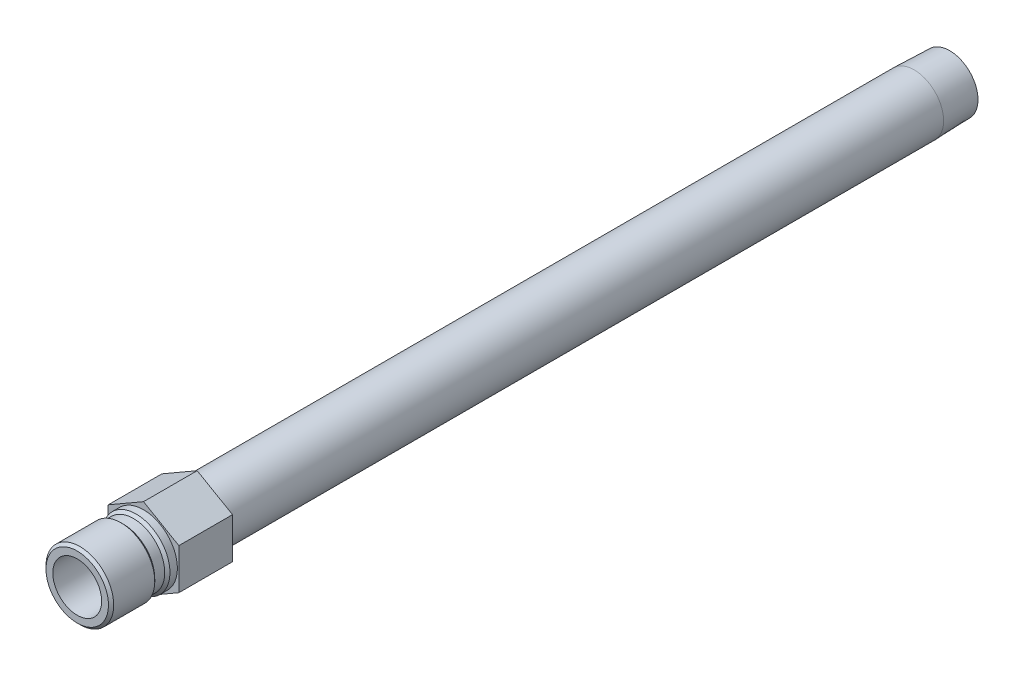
ISO-10303-21;
HEADER;
FILE_DESCRIPTION(('STEP AP214'),'2;1');
FILE_NAME('part.step','',(''),(''),'','','');
FILE_SCHEMA(('AUTOMOTIVE_DESIGN { 1 0 10303 214 1 1 1 1 }'));
ENDSEC;
DATA;
#1=APPLICATION_CONTEXT('core data for automotive mechanical design processes');
#2=APPLICATION_PROTOCOL_DEFINITION('international standard','automotive_design',2000,#1);
#3=PRODUCT_CONTEXT('',#1,'mechanical');
#4=PRODUCT('Part','Part','',(#3));
#5=PRODUCT_RELATED_PRODUCT_CATEGORY('part','',(#4));
#6=PRODUCT_DEFINITION_FORMATION('','',#4);
#7=PRODUCT_DEFINITION_CONTEXT('part definition',#1,'design');
#8=PRODUCT_DEFINITION('design','',#6,#7);
#9=PRODUCT_DEFINITION_SHAPE('','',#8);
#10=(LENGTH_UNIT() NAMED_UNIT(*) SI_UNIT(.MILLI.,.METRE.));
#11=(NAMED_UNIT(*) PLANE_ANGLE_UNIT() SI_UNIT($,.RADIAN.));
#12=(NAMED_UNIT(*) SI_UNIT($,.STERADIAN.) SOLID_ANGLE_UNIT());
#13=UNCERTAINTY_MEASURE_WITH_UNIT(LENGTH_MEASURE(1.E-05),#10,'distance_accuracy_value','');
#14=(GEOMETRIC_REPRESENTATION_CONTEXT(3) GLOBAL_UNCERTAINTY_ASSIGNED_CONTEXT((#13)) GLOBAL_UNIT_ASSIGNED_CONTEXT((#10,
#11,#12)) REPRESENTATION_CONTEXT('',''));
#15=CARTESIAN_POINT('',(0.,0.,0.));
#16=DIRECTION('',(0.,0.,1.));
#17=DIRECTION('',(1.,0.,0.));
#18=AXIS2_PLACEMENT_3D('',#15,#16,#17);
#19=CARTESIAN_POINT('',(0.,0.,0.));
#20=DIRECTION('',(0.,0.,-1.));
#21=DIRECTION('',(0.,1.,0.));
#22=AXIS2_PLACEMENT_3D('',#19,#20,#21);
#23=CYLINDRICAL_SURFACE('',#22,8.5725);
#24=CARTESIAN_POINT('',(0.,0.,-224.3582));
#25=DIRECTION('',(0.,0.,-1.));
#26=DIRECTION('',(0.,1.,0.));
#27=AXIS2_PLACEMENT_3D('',#24,#25,#26);
#28=CIRCLE('',#27,8.57250000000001);
#29=CARTESIAN_POINT('',(0.,8.5725,-224.3582));
#30=VERTEX_POINT('',#29);
#31=EDGE_CURVE('E158',#30,#30,#28,.T.);
#32=ORIENTED_EDGE('',*,*,#31,.F.);
#33=EDGE_LOOP('',(#32));
#34=FACE_BOUND('',#33,.T.);
#35=CARTESIAN_POINT('',(0.,0.,-15.621));
#36=DIRECTION('',(0.,0.,1.));
#37=DIRECTION('',(1.,0.,0.));
#38=AXIS2_PLACEMENT_3D('',#35,#36,#37);
#39=CIRCLE('',#38,8.5725);
#40=CARTESIAN_POINT('',(8.5725,0.,-15.621));
#41=VERTEX_POINT('',#40);
#42=EDGE_CURVE('E39',#41,#41,#39,.F.);
#43=ORIENTED_EDGE('',*,*,#42,.T.);
#44=EDGE_LOOP('',(#43));
#45=FACE_BOUND('',#44,.T.);
#46=ADVANCED_FACE('F35',(#34,#45),#23,.T.);
#47=CARTESIAN_POINT('',(0.,0.,0.));
#48=DIRECTION('',(0.,0.,-1.));
#49=DIRECTION('',(0.,1.,0.));
#50=AXIS2_PLACEMENT_3D('',#47,#48,#49);
#51=CYLINDRICAL_SURFACE('',#50,7.112);
#52=CARTESIAN_POINT('',(0.,0.,1.524));
#53=DIRECTION('',(0.,0.,-1.));
#54=DIRECTION('',(0.,1.,0.));
#55=AXIS2_PLACEMENT_3D('',#52,#53,#54);
#56=CIRCLE('',#55,7.112);
#57=CARTESIAN_POINT('',(0.,7.112,1.524));
#58=VERTEX_POINT('',#57);
#59=EDGE_CURVE('E146',#58,#58,#56,.T.);
#60=ORIENTED_EDGE('',*,*,#59,.T.);
#61=EDGE_LOOP('',(#60));
#62=FACE_BOUND('',#61,.T.);
#63=CARTESIAN_POINT('',(0.,0.,19.304));
#64=DIRECTION('',(0.,0.,-1.));
#65=DIRECTION('',(0.,1.,0.));
#66=AXIS2_PLACEMENT_3D('',#63,#64,#65);
#67=CIRCLE('',#66,7.112);
#68=CARTESIAN_POINT('',(0.,7.112,19.304));
#69=VERTEX_POINT('',#68);
#70=EDGE_CURVE('E11',#69,#69,#67,.T.);
#71=ORIENTED_EDGE('',*,*,#70,.F.);
#72=EDGE_LOOP('',(#71));
#73=FACE_BOUND('',#72,.T.);
#74=ADVANCED_FACE('F37',(#62,#73),#51,.F.);
#75=CARTESIAN_POINT('',(0.,7.112,19.304));
#76=DIRECTION('',(0.,0.,1.));
#77=DIRECTION('',(0.,-1.,0.));
#78=AXIS2_PLACEMENT_3D('',#75,#76,#77);
#79=PLANE('',#78);
#80=ORIENTED_EDGE('',*,*,#70,.T.);
#81=EDGE_LOOP('',(#80));
#82=FACE_BOUND('',#81,.T.);
#83=CARTESIAN_POINT('',(0.,0.,19.304));
#84=DIRECTION('',(0.,0.,-1.));
#85=DIRECTION('',(0.,1.,0.));
#86=AXIS2_PLACEMENT_3D('',#83,#84,#85);
#87=CIRCLE('',#86,9.09319999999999);
#88=CARTESIAN_POINT('',(0.,9.0932,19.304));
#89=VERTEX_POINT('',#88);
#90=EDGE_CURVE('E45',#89,#89,#87,.T.);
#91=ORIENTED_EDGE('',*,*,#90,.F.);
#92=EDGE_LOOP('',(#91));
#93=FACE_BOUND('',#92,.T.);
#94=ADVANCED_FACE('F185',(#82,#93),#79,.T.);
#95=CARTESIAN_POINT('',(0.,0.,18.542));
#96=DIRECTION('',(0.,0.,-1.));
#97=DIRECTION('',(0.,1.,0.));
#98=AXIS2_PLACEMENT_3D('',#95,#96,#97);
#99=CONICAL_SURFACE('',#98,9.8552,0.785398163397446);
#100=ORIENTED_EDGE('',*,*,#90,.T.);
#101=EDGE_LOOP('',(#100));
#102=FACE_BOUND('',#101,.T.);
#103=CARTESIAN_POINT('',(0.,0.,18.542));
#104=DIRECTION('',(0.,0.,-1.));
#105=DIRECTION('',(0.,1.,0.));
#106=AXIS2_PLACEMENT_3D('',#103,#104,#105);
#107=CIRCLE('',#106,9.8552);
#108=CARTESIAN_POINT('',(0.,9.8552,18.542));
#109=VERTEX_POINT('',#108);
#110=EDGE_CURVE('E176',#109,#109,#107,.T.);
#111=ORIENTED_EDGE('',*,*,#110,.F.);
#112=EDGE_LOOP('',(#111));
#113=FACE_BOUND('',#112,.T.);
#114=ADVANCED_FACE('F182',(#102,#113),#99,.T.);
#115=CARTESIAN_POINT('',(0.,0.,0.));
#116=DIRECTION('',(0.,0.,-1.));
#117=DIRECTION('',(0.,1.,0.));
#118=AXIS2_PLACEMENT_3D('',#115,#116,#117);
#119=CYLINDRICAL_SURFACE('',#118,9.8552);
#120=ORIENTED_EDGE('',*,*,#110,.T.);
#121=EDGE_LOOP('',(#120));
#122=FACE_BOUND('',#121,.T.);
#123=CARTESIAN_POINT('',(0.,0.,6.5786));
#124=DIRECTION('',(0.,0.,-1.));
#125=DIRECTION('',(0.,1.,0.));
#126=AXIS2_PLACEMENT_3D('',#123,#124,#125);
#127=CIRCLE('',#126,9.8552);
#128=CARTESIAN_POINT('',(0.,9.8552,6.5786));
#129=VERTEX_POINT('',#128);
#130=EDGE_CURVE('E173',#129,#129,#127,.T.);
#131=ORIENTED_EDGE('',*,*,#130,.F.);
#132=EDGE_LOOP('',(#131));
#133=FACE_BOUND('',#132,.T.);
#134=ADVANCED_FACE('F192',(#122,#133),#119,.T.);
#135=CARTESIAN_POINT('',(0.,0.,5.8166));
#136=DIRECTION('',(0.,0.,1.));
#137=DIRECTION('',(0.,-1.,0.));
#138=AXIS2_PLACEMENT_3D('',#135,#136,#137);
#139=CONICAL_SURFACE('',#138,9.0932,0.785398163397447);
#140=ORIENTED_EDGE('',*,*,#130,.T.);
#141=EDGE_LOOP('',(#140));
#142=FACE_BOUND('',#141,.T.);
#143=CARTESIAN_POINT('',(0.,0.,5.8166));
#144=DIRECTION('',(0.,0.,-1.));
#145=DIRECTION('',(0.,1.,0.));
#146=AXIS2_PLACEMENT_3D('',#143,#144,#145);
#147=CIRCLE('',#146,9.0932);
#148=CARTESIAN_POINT('',(0.,9.0932,5.8166));
#149=VERTEX_POINT('',#148);
#150=EDGE_CURVE('E170',#149,#149,#147,.T.);
#151=ORIENTED_EDGE('',*,*,#150,.F.);
#152=EDGE_LOOP('',(#151));
#153=FACE_BOUND('',#152,.T.);
#154=ADVANCED_FACE('F217',(#142,#153),#139,.T.);
#155=CARTESIAN_POINT('',(0.,0.,0.));
#156=DIRECTION('',(0.,0.,-1.));
#157=DIRECTION('',(0.,1.,0.));
#158=AXIS2_PLACEMENT_3D('',#155,#156,#157);
#159=CYLINDRICAL_SURFACE('',#158,9.0932);
#160=ORIENTED_EDGE('',*,*,#150,.T.);
#161=EDGE_LOOP('',(#160));
#162=FACE_BOUND('',#161,.T.);
#163=CARTESIAN_POINT('',(0.,0.,2.921));
#164=DIRECTION('',(0.,0.,-1.));
#165=DIRECTION('',(0.,1.,0.));
#166=AXIS2_PLACEMENT_3D('',#163,#164,#165);
#167=CIRCLE('',#166,9.0932);
#168=CARTESIAN_POINT('',(0.,9.0932,2.921));
#169=VERTEX_POINT('',#168);
#170=EDGE_CURVE('E167',#169,#169,#167,.T.);
#171=ORIENTED_EDGE('',*,*,#170,.F.);
#172=EDGE_LOOP('',(#171));
#173=FACE_BOUND('',#172,.T.);
#174=ADVANCED_FACE('F213',(#162,#173),#159,.T.);
#175=CARTESIAN_POINT('',(0.,0.,2.159));
#176=DIRECTION('',(0.,0.,-1.));
#177=DIRECTION('',(0.,1.,0.));
#178=AXIS2_PLACEMENT_3D('',#175,#176,#177);
#179=CONICAL_SURFACE('',#178,9.8552,0.785398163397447);
#180=ORIENTED_EDGE('',*,*,#170,.T.);
#181=EDGE_LOOP('',(#180));
#182=FACE_BOUND('',#181,.T.);
#183=CARTESIAN_POINT('',(0.,0.,2.159));
#184=DIRECTION('',(0.,0.,-1.));
#185=DIRECTION('',(0.,1.,0.));
#186=AXIS2_PLACEMENT_3D('',#183,#184,#185);
#187=CIRCLE('',#186,9.8552);
#188=CARTESIAN_POINT('',(0.,9.8552,2.159));
#189=VERTEX_POINT('',#188);
#190=EDGE_CURVE('E164',#189,#189,#187,.T.);
#191=ORIENTED_EDGE('',*,*,#190,.F.);
#192=EDGE_LOOP('',(#191));
#193=FACE_BOUND('',#192,.T.);
#194=ADVANCED_FACE('F209',(#182,#193),#179,.T.);
#195=CARTESIAN_POINT('',(0.,0.,0.));
#196=DIRECTION('',(0.,0.,-1.));
#197=DIRECTION('',(0.,1.,0.));
#198=AXIS2_PLACEMENT_3D('',#195,#196,#197);
#199=CYLINDRICAL_SURFACE('',#198,9.8552);
#200=ORIENTED_EDGE('',*,*,#190,.T.);
#201=EDGE_LOOP('',(#200));
#202=FACE_BOUND('',#201,.T.);
#203=CARTESIAN_POINT('',(0.,0.,0.));
#204=DIRECTION('',(0.,0.,-1.));
#205=DIRECTION('',(0.,1.,0.));
#206=AXIS2_PLACEMENT_3D('',#203,#204,#205);
#207=CIRCLE('',#206,9.8552);
#208=CARTESIAN_POINT('',(0.,9.8552,0.));
#209=VERTEX_POINT('',#208);
#210=EDGE_CURVE('E161',#209,#209,#207,.T.);
#211=ORIENTED_EDGE('',*,*,#210,.F.);
#212=EDGE_LOOP('',(#211));
#213=FACE_BOUND('',#212,.T.);
#214=ADVANCED_FACE('F206',(#202,#213),#199,.T.);
#215=CARTESIAN_POINT('',(0.,0.,-234.696));
#216=DIRECTION('',(0.,0.,1.));
#217=DIRECTION('',(0.,-1.,0.));
#218=AXIS2_PLACEMENT_3D('',#215,#216,#217);
#219=CONICAL_SURFACE('',#218,8.24944566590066,0.0312396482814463);
#220=ORIENTED_EDGE('',*,*,#31,.T.);
#221=EDGE_LOOP('',(#220));
#222=FACE_BOUND('',#221,.T.);
#223=CARTESIAN_POINT('',(0.,0.,-234.696));
#224=DIRECTION('',(0.,0.,-1.));
#225=DIRECTION('',(0.,1.,0.));
#226=AXIS2_PLACEMENT_3D('',#223,#224,#225);
#227=CIRCLE('',#226,8.24944566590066);
#228=CARTESIAN_POINT('',(0.,8.24944566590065,-234.696));
#229=VERTEX_POINT('',#228);
#230=EDGE_CURVE('E155',#229,#229,#227,.T.);
#231=ORIENTED_EDGE('',*,*,#230,.F.);
#232=EDGE_LOOP('',(#231));
#233=FACE_BOUND('',#232,.T.);
#234=ADVANCED_FACE('F204',(#222,#233),#219,.T.);
#235=CARTESIAN_POINT('',(0.,8.24944566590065,-234.696));
#236=DIRECTION('',(0.,0.,-1.));
#237=DIRECTION('',(0.,1.,0.));
#238=AXIS2_PLACEMENT_3D('',#235,#236,#237);
#239=PLANE('',#238);
#240=ORIENTED_EDGE('',*,*,#230,.T.);
#241=EDGE_LOOP('',(#240));
#242=FACE_BOUND('',#241,.T.);
#243=CARTESIAN_POINT('',(0.,0.,-234.696));
#244=DIRECTION('',(0.,0.,-1.));
#245=DIRECTION('',(0.,1.,0.));
#246=AXIS2_PLACEMENT_3D('',#243,#244,#245);
#247=CIRCLE('',#246,6.2611);
#248=CARTESIAN_POINT('',(0.,6.2611,-234.696));
#249=VERTEX_POINT('',#248);
#250=EDGE_CURVE('E152',#249,#249,#247,.T.);
#251=ORIENTED_EDGE('',*,*,#250,.F.);
#252=EDGE_LOOP('',(#251));
#253=FACE_BOUND('',#252,.T.);
#254=ADVANCED_FACE('F270',(#242,#253),#239,.T.);
#255=CARTESIAN_POINT('',(0.,0.,0.));
#256=DIRECTION('',(0.,0.,-1.));
#257=DIRECTION('',(0.,1.,0.));
#258=AXIS2_PLACEMENT_3D('',#255,#256,#257);
#259=CYLINDRICAL_SURFACE('',#258,6.2611);
#260=ORIENTED_EDGE('',*,*,#250,.T.);
#261=EDGE_LOOP('',(#260));
#262=FACE_BOUND('',#261,.T.);
#263=CARTESIAN_POINT('',(0.,0.,1.07156844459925));
#264=DIRECTION('',(0.,0.,-1.));
#265=DIRECTION('',(0.,1.,0.));
#266=AXIS2_PLACEMENT_3D('',#263,#264,#265);
#267=CIRCLE('',#266,6.2611);
#268=CARTESIAN_POINT('',(0.,6.2611,1.07156844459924));
#269=VERTEX_POINT('',#268);
#270=EDGE_CURVE('E149',#269,#269,#267,.T.);
#271=ORIENTED_EDGE('',*,*,#270,.F.);
#272=EDGE_LOOP('',(#271));
#273=FACE_BOUND('',#272,.T.);
#274=ADVANCED_FACE('F267',(#262,#273),#259,.F.);
#275=CARTESIAN_POINT('',(0.,0.,1.524));
#276=DIRECTION('',(0.,0.,1.));
#277=DIRECTION('',(0.,-1.,0.));
#278=AXIS2_PLACEMENT_3D('',#275,#276,#277);
#279=CONICAL_SURFACE('',#278,7.112,1.08210413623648);
#280=ORIENTED_EDGE('',*,*,#270,.T.);
#281=EDGE_LOOP('',(#280));
#282=FACE_BOUND('',#281,.T.);
#283=ORIENTED_EDGE('',*,*,#59,.F.);
#284=EDGE_LOOP('',(#283));
#285=FACE_BOUND('',#284,.T.);
#286=ADVANCED_FACE('F255',(#282,#285),#279,.F.);
#287=CARTESIAN_POINT('',(0.,11.8784044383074,-15.621));
#288=DIRECTION('',(-0.5,0.866025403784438,0.));
#289=DIRECTION('',(-0.866025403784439,-0.5,0.));
#290=AXIS2_PLACEMENT_3D('',#287,#288,#289);
#291=PLANE('',#290);
#292=DIRECTION('',(-0.866025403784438,-0.5,0.));
#293=VECTOR('',#292,1.);
#294=CARTESIAN_POINT('',(0.,11.8784044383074,0.));
#295=LINE('',#294,#293);
#296=CARTESIAN_POINT('',(0.,11.8784044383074,0.));
#297=VERTEX_POINT('',#296);
#298=CARTESIAN_POINT('',(-10.287,5.93920221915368,0.));
#299=VERTEX_POINT('',#298);
#300=EDGE_CURVE('E124',#297,#299,#295,.T.);
#301=ORIENTED_EDGE('',*,*,#300,.F.);
#302=DIRECTION('',(0.,0.,1.));
#303=VECTOR('',#302,1.);
#304=CARTESIAN_POINT('',(0.,11.8784044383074,-15.621));
#305=LINE('',#304,#303);
#306=CARTESIAN_POINT('',(0.,11.8784044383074,-15.621));
#307=VERTEX_POINT('',#306);
#308=EDGE_CURVE('E53',#307,#297,#305,.T.);
#309=ORIENTED_EDGE('',*,*,#308,.F.);
#310=DIRECTION('',(-0.866025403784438,-0.5,0.));
#311=VECTOR('',#310,1.);
#312=CARTESIAN_POINT('',(0.,11.8784044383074,-15.621));
#313=LINE('',#312,#311);
#314=CARTESIAN_POINT('',(-10.287,5.93920221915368,-15.621));
#315=VERTEX_POINT('',#314);
#316=EDGE_CURVE('E139',#307,#315,#313,.T.);
#317=ORIENTED_EDGE('',*,*,#316,.T.);
#318=DIRECTION('',(0.,0.,1.));
#319=VECTOR('',#318,1.);
#320=CARTESIAN_POINT('',(-10.287,5.93920221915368,-15.621));
#321=LINE('',#320,#319);
#322=EDGE_CURVE('E88',#315,#299,#321,.T.);
#323=ORIENTED_EDGE('',*,*,#322,.T.);
#324=EDGE_LOOP('',(#301,#309,#317,#323));
#325=FACE_BOUND('',#324,.T.);
#326=ADVANCED_FACE('F242',(#325),#291,.T.);
#327=CARTESIAN_POINT('',(10.287,5.93920221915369,-15.621));
#328=DIRECTION('',(0.5,0.866025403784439,0.));
#329=DIRECTION('',(-0.866025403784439,0.5,0.));
#330=AXIS2_PLACEMENT_3D('',#327,#328,#329);
#331=PLANE('',#330);
#332=DIRECTION('',(-0.866025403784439,0.5,0.));
#333=VECTOR('',#332,1.);
#334=CARTESIAN_POINT('',(10.287,5.93920221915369,0.));
#335=LINE('',#334,#333);
#336=CARTESIAN_POINT('',(10.287,5.93920221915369,0.));
#337=VERTEX_POINT('',#336);
#338=EDGE_CURVE('E136',#337,#297,#335,.T.);
#339=ORIENTED_EDGE('',*,*,#338,.F.);
#340=DIRECTION('',(0.,0.,1.));
#341=VECTOR('',#340,1.);
#342=CARTESIAN_POINT('',(10.287,5.93920221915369,-15.621));
#343=LINE('',#342,#341);
#344=CARTESIAN_POINT('',(10.287,5.93920221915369,-15.621));
#345=VERTEX_POINT('',#344);
#346=EDGE_CURVE('E76',#345,#337,#343,.T.);
#347=ORIENTED_EDGE('',*,*,#346,.F.);
#348=DIRECTION('',(-0.866025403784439,0.5,0.));
#349=VECTOR('',#348,1.);
#350=CARTESIAN_POINT('',(10.287,5.93920221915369,-15.621));
#351=LINE('',#350,#349);
#352=EDGE_CURVE('E114',#345,#307,#351,.T.);
#353=ORIENTED_EDGE('',*,*,#352,.T.);
#354=ORIENTED_EDGE('',*,*,#308,.T.);
#355=EDGE_LOOP('',(#339,#347,#353,#354));
#356=FACE_BOUND('',#355,.T.);
#357=ADVANCED_FACE('F247',(#356),#331,.T.);
#358=CARTESIAN_POINT('',(10.287,-5.93920221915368,-15.621));
#359=DIRECTION('',(1.,0.,0.));
#360=DIRECTION('',(0.,0.,-1.));
#361=AXIS2_PLACEMENT_3D('',#358,#359,#360);
#362=PLANE('',#361);
#363=DIRECTION('',(0.,1.,0.));
#364=VECTOR('',#363,1.);
#365=CARTESIAN_POINT('',(10.287,-5.93920221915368,0.));
#366=LINE('',#365,#364);
#367=CARTESIAN_POINT('',(10.287,-5.93920221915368,0.));
#368=VERTEX_POINT('',#367);
#369=EDGE_CURVE('E101',#368,#337,#366,.T.);
#370=ORIENTED_EDGE('',*,*,#369,.F.);
#371=DIRECTION('',(0.,0.,1.));
#372=VECTOR('',#371,1.);
#373=CARTESIAN_POINT('',(10.287,-5.93920221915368,-15.621));
#374=LINE('',#373,#372);
#375=CARTESIAN_POINT('',(10.287,-5.93920221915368,-15.621));
#376=VERTEX_POINT('',#375);
#377=EDGE_CURVE('E96',#376,#368,#374,.T.);
#378=ORIENTED_EDGE('',*,*,#377,.F.);
#379=DIRECTION('',(0.,1.,0.));
#380=VECTOR('',#379,1.);
#381=CARTESIAN_POINT('',(10.287,-5.93920221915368,-15.621));
#382=LINE('',#381,#380);
#383=EDGE_CURVE('E99',#376,#345,#382,.T.);
#384=ORIENTED_EDGE('',*,*,#383,.T.);
#385=ORIENTED_EDGE('',*,*,#346,.T.);
#386=EDGE_LOOP('',(#370,#378,#384,#385));
#387=FACE_BOUND('',#386,.T.);
#388=ADVANCED_FACE('F98',(#387),#362,.T.);
#389=CARTESIAN_POINT('',(0.,-11.8784044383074,-15.621));
#390=DIRECTION('',(0.5,-0.866025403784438,0.));
#391=DIRECTION('',(0.866025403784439,0.5,0.));
#392=AXIS2_PLACEMENT_3D('',#389,#390,#391);
#393=PLANE('',#392);
#394=DIRECTION('',(0.866025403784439,0.5,0.));
#395=VECTOR('',#394,1.);
#396=CARTESIAN_POINT('',(0.,-11.8784044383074,0.));
#397=LINE('',#396,#395);
#398=CARTESIAN_POINT('',(0.,-11.8784044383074,0.));
#399=VERTEX_POINT('',#398);
#400=EDGE_CURVE('E133',#399,#368,#397,.T.);
#401=ORIENTED_EDGE('',*,*,#400,.F.);
#402=DIRECTION('',(0.,0.,1.));
#403=VECTOR('',#402,1.);
#404=CARTESIAN_POINT('',(0.,-11.8784044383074,-15.621));
#405=LINE('',#404,#403);
#406=CARTESIAN_POINT('',(0.,-11.8784044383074,-15.621));
#407=VERTEX_POINT('',#406);
#408=EDGE_CURVE('E106',#407,#399,#405,.T.);
#409=ORIENTED_EDGE('',*,*,#408,.F.);
#410=DIRECTION('',(0.866025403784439,0.5,0.));
#411=VECTOR('',#410,1.);
#412=CARTESIAN_POINT('',(0.,-11.8784044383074,-15.621));
#413=LINE('',#412,#411);
#414=EDGE_CURVE('E112',#407,#376,#413,.T.);
#415=ORIENTED_EDGE('',*,*,#414,.T.);
#416=ORIENTED_EDGE('',*,*,#377,.T.);
#417=EDGE_LOOP('',(#401,#409,#415,#416));
#418=FACE_BOUND('',#417,.T.);
#419=ADVANCED_FACE('F116',(#418),#393,.T.);
#420=CARTESIAN_POINT('',(-10.287,-5.93920221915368,-15.621));
#421=DIRECTION('',(-0.5,-0.866025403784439,0.));
#422=DIRECTION('',(0.866025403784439,-0.5,0.));
#423=AXIS2_PLACEMENT_3D('',#420,#421,#422);
#424=PLANE('',#423);
#425=DIRECTION('',(0.866025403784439,-0.5,0.));
#426=VECTOR('',#425,1.);
#427=CARTESIAN_POINT('',(-10.287,-5.93920221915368,0.));
#428=LINE('',#427,#426);
#429=CARTESIAN_POINT('',(-10.287,-5.93920221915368,0.));
#430=VERTEX_POINT('',#429);
#431=EDGE_CURVE('E130',#430,#399,#428,.T.);
#432=ORIENTED_EDGE('',*,*,#431,.F.);
#433=DIRECTION('',(0.,0.,1.));
#434=VECTOR('',#433,1.);
#435=CARTESIAN_POINT('',(-10.287,-5.93920221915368,-15.621));
#436=LINE('',#435,#434);
#437=CARTESIAN_POINT('',(-10.287,-5.93920221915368,-15.621));
#438=VERTEX_POINT('',#437);
#439=EDGE_CURVE('E143',#438,#430,#436,.T.);
#440=ORIENTED_EDGE('',*,*,#439,.F.);
#441=DIRECTION('',(0.866025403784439,-0.5,0.));
#442=VECTOR('',#441,1.);
#443=CARTESIAN_POINT('',(-10.287,-5.93920221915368,-15.621));
#444=LINE('',#443,#442);
#445=EDGE_CURVE('E117',#438,#407,#444,.T.);
#446=ORIENTED_EDGE('',*,*,#445,.T.);
#447=ORIENTED_EDGE('',*,*,#408,.T.);
#448=EDGE_LOOP('',(#432,#440,#446,#447));
#449=FACE_BOUND('',#448,.T.);
#450=ADVANCED_FACE('F246',(#449),#424,.T.);
#451=CARTESIAN_POINT('',(-10.287,5.93920221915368,-15.621));
#452=DIRECTION('',(-1.,0.,0.));
#453=DIRECTION('',(0.,0.,1.));
#454=AXIS2_PLACEMENT_3D('',#451,#452,#453);
#455=PLANE('',#454);
#456=DIRECTION('',(0.,-1.,0.));
#457=VECTOR('',#456,1.);
#458=CARTESIAN_POINT('',(-10.287,5.93920221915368,0.));
#459=LINE('',#458,#457);
#460=EDGE_CURVE('E127',#299,#430,#459,.T.);
#461=ORIENTED_EDGE('',*,*,#460,.F.);
#462=ORIENTED_EDGE('',*,*,#322,.F.);
#463=DIRECTION('',(0.,-1.,0.));
#464=VECTOR('',#463,1.);
#465=CARTESIAN_POINT('',(-10.287,5.93920221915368,-15.621));
#466=LINE('',#465,#464);
#467=EDGE_CURVE('E119',#315,#438,#466,.T.);
#468=ORIENTED_EDGE('',*,*,#467,.T.);
#469=ORIENTED_EDGE('',*,*,#439,.T.);
#470=EDGE_LOOP('',(#461,#462,#468,#469));
#471=FACE_BOUND('',#470,.T.);
#472=ADVANCED_FACE('F243',(#471),#455,.T.);
#473=CARTESIAN_POINT('',(-10.287,5.93920221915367,-15.621));
#474=DIRECTION('',(0.,0.,1.));
#475=DIRECTION('',(1.,0.,0.));
#476=AXIS2_PLACEMENT_3D('',#473,#474,#475);
#477=PLANE('',#476);
#478=ORIENTED_EDGE('',*,*,#42,.F.);
#479=EDGE_LOOP('',(#478));
#480=FACE_BOUND('',#479,.T.);
#481=ORIENTED_EDGE('',*,*,#316,.F.);
#482=ORIENTED_EDGE('',*,*,#352,.F.);
#483=ORIENTED_EDGE('',*,*,#383,.F.);
#484=ORIENTED_EDGE('',*,*,#414,.F.);
#485=ORIENTED_EDGE('',*,*,#445,.F.);
#486=ORIENTED_EDGE('',*,*,#467,.F.);
#487=EDGE_LOOP('',(#481,#482,#483,#484,#485,#486));
#488=FACE_BOUND('',#487,.T.);
#489=ADVANCED_FACE('F110',(#480,#488),#477,.F.);
#490=CARTESIAN_POINT('',(-10.287,5.93920221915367,0.));
#491=DIRECTION('',(0.,0.,1.));
#492=DIRECTION('',(1.,0.,0.));
#493=AXIS2_PLACEMENT_3D('',#490,#491,#492);
#494=PLANE('',#493);
#495=ORIENTED_EDGE('',*,*,#210,.T.);
#496=EDGE_LOOP('',(#495));
#497=FACE_BOUND('',#496,.T.);
#498=ORIENTED_EDGE('',*,*,#300,.T.);
#499=ORIENTED_EDGE('',*,*,#460,.T.);
#500=ORIENTED_EDGE('',*,*,#431,.T.);
#501=ORIENTED_EDGE('',*,*,#400,.T.);
#502=ORIENTED_EDGE('',*,*,#369,.T.);
#503=ORIENTED_EDGE('',*,*,#338,.T.);
#504=EDGE_LOOP('',(#498,#499,#500,#501,#502,#503));
#505=FACE_BOUND('',#504,.T.);
#506=ADVANCED_FACE('F238',(#497,#505),#494,.T.);
#507=CLOSED_SHELL('',(#46,#74,#94,#114,#134,#154,#174,#194,#214,#234,#254,#274,#286,#326,#357,
#388,#419,#450,#472,#489,#506));
#508=MANIFOLD_SOLID_BREP('B2',#507);
#509=ADVANCED_BREP_SHAPE_REPRESENTATION('',(#18,#508),#14);
#510=SHAPE_DEFINITION_REPRESENTATION(#9,#509);
ENDSEC;
END-ISO-10303-21;
